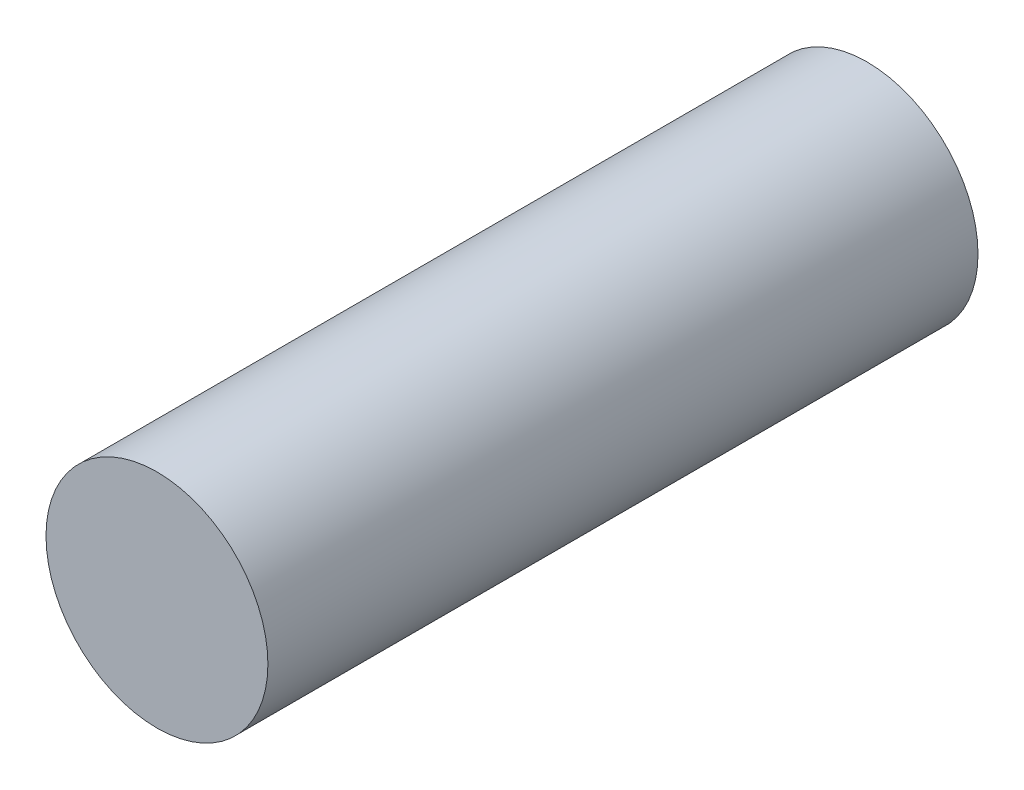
from build123d import *

# Parameters (mm, degrees)
SKETCH1_R           = 3.175
BOSS_EXTRUDE1_DEPTH = 20.32


with BuildPart() as part:
    # Sketch1 → Boss-Extrude1 (new body)
    with BuildSketch(Plane.XY):
        Circle(SKETCH1_R)
    extrude(amount=BOSS_EXTRUDE1_DEPTH)


solid = part.part
